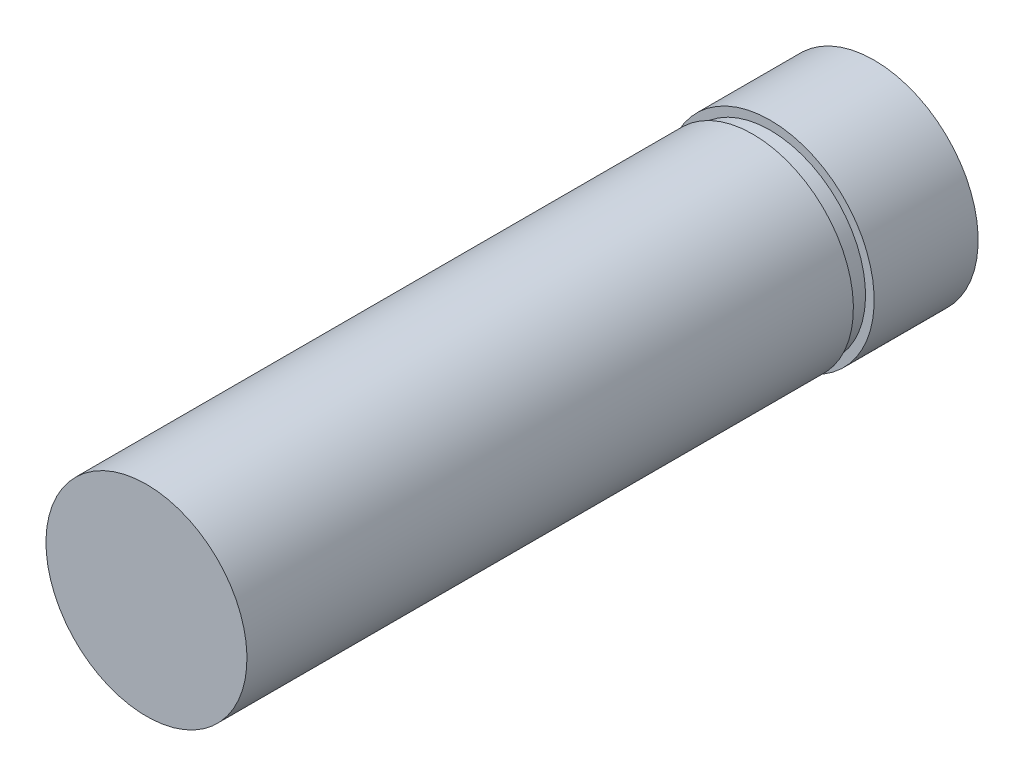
ISO-10303-21;
HEADER;
FILE_DESCRIPTION(('STEP AP214'),'2;1');
FILE_NAME('part.step','',(''),(''),'','','');
FILE_SCHEMA(('AUTOMOTIVE_DESIGN { 1 0 10303 214 1 1 1 1 }'));
ENDSEC;
DATA;
#1=APPLICATION_CONTEXT('core data for automotive mechanical design processes');
#2=APPLICATION_PROTOCOL_DEFINITION('international standard','automotive_design',2000,#1);
#3=PRODUCT_CONTEXT('',#1,'mechanical');
#4=PRODUCT('Part','Part','',(#3));
#5=PRODUCT_RELATED_PRODUCT_CATEGORY('part','',(#4));
#6=PRODUCT_DEFINITION_FORMATION('','',#4);
#7=PRODUCT_DEFINITION_CONTEXT('part definition',#1,'design');
#8=PRODUCT_DEFINITION('design','',#6,#7);
#9=PRODUCT_DEFINITION_SHAPE('','',#8);
#10=(LENGTH_UNIT() NAMED_UNIT(*) SI_UNIT(.MILLI.,.METRE.));
#11=(NAMED_UNIT(*) PLANE_ANGLE_UNIT() SI_UNIT($,.RADIAN.));
#12=(NAMED_UNIT(*) SI_UNIT($,.STERADIAN.) SOLID_ANGLE_UNIT());
#13=UNCERTAINTY_MEASURE_WITH_UNIT(LENGTH_MEASURE(1.E-05),#10,'distance_accuracy_value','');
#14=(GEOMETRIC_REPRESENTATION_CONTEXT(3) GLOBAL_UNCERTAINTY_ASSIGNED_CONTEXT((#13)) GLOBAL_UNIT_ASSIGNED_CONTEXT((#10,
#11,#12)) REPRESENTATION_CONTEXT('',''));
#15=CARTESIAN_POINT('',(0.,0.,0.));
#16=DIRECTION('',(0.,0.,1.));
#17=DIRECTION('',(1.,0.,0.));
#18=AXIS2_PLACEMENT_3D('',#15,#16,#17);
#19=CARTESIAN_POINT('',(2.9,0.,17.6));
#20=DIRECTION('',(0.,0.,1.));
#21=DIRECTION('',(0.,-1.,0.));
#22=AXIS2_PLACEMENT_3D('',#19,#20,#21);
#23=PLANE('',#22);
#24=CARTESIAN_POINT('',(0.,0.,17.6));
#25=DIRECTION('',(0.,0.,-1.));
#26=DIRECTION('',(0.,1.,0.));
#27=AXIS2_PLACEMENT_3D('',#24,#25,#26);
#28=CIRCLE('',#27,2.9);
#29=CARTESIAN_POINT('',(0.,2.90000000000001,17.6));
#30=VERTEX_POINT('',#29);
#31=EDGE_CURVE('E53',#30,#30,#28,.T.);
#32=ORIENTED_EDGE('',*,*,#31,.F.);
#33=EDGE_LOOP('',(#32));
#34=FACE_BOUND('',#33,.T.);
#35=ADVANCED_FACE('F31',(#34),#23,.T.);
#36=CARTESIAN_POINT('',(0.,0.,-3.4));
#37=DIRECTION('',(0.,0.,-1.));
#38=DIRECTION('',(0.,1.,0.));
#39=AXIS2_PLACEMENT_3D('',#36,#37,#38);
#40=PLANE('',#39);
#41=CARTESIAN_POINT('',(0.,0.,-3.4));
#42=DIRECTION('',(0.,0.,-1.));
#43=DIRECTION('',(0.,1.,0.));
#44=AXIS2_PLACEMENT_3D('',#41,#42,#43);
#45=CIRCLE('',#44,3.);
#46=CARTESIAN_POINT('',(0.,3.,-3.4));
#47=VERTEX_POINT('',#46);
#48=EDGE_CURVE('E10',#47,#47,#45,.T.);
#49=ORIENTED_EDGE('',*,*,#48,.T.);
#50=EDGE_LOOP('',(#49));
#51=FACE_BOUND('',#50,.T.);
#52=ADVANCED_FACE('F61',(#51),#40,.T.);
#53=CARTESIAN_POINT('',(0.,0.,17.6));
#54=DIRECTION('',(0.,0.,-1.));
#55=DIRECTION('',(0.,1.,0.));
#56=AXIS2_PLACEMENT_3D('',#53,#54,#55);
#57=CYLINDRICAL_SURFACE('',#56,3.);
#58=CARTESIAN_POINT('',(0.,0.,-0.399999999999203));
#59=DIRECTION('',(0.,0.,-1.));
#60=DIRECTION('',(0.,1.,0.));
#61=AXIS2_PLACEMENT_3D('',#58,#59,#60);
#62=CIRCLE('',#61,3.);
#63=CARTESIAN_POINT('',(0.,3.,-0.399999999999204));
#64=VERTEX_POINT('',#63);
#65=EDGE_CURVE('E37',#64,#64,#62,.T.);
#66=ORIENTED_EDGE('',*,*,#65,.T.);
#67=EDGE_LOOP('',(#66));
#68=FACE_BOUND('',#67,.T.);
#69=ORIENTED_EDGE('',*,*,#48,.F.);
#70=EDGE_LOOP('',(#69));
#71=FACE_BOUND('',#70,.T.);
#72=ADVANCED_FACE('F65',(#68,#71),#57,.T.);
#73=CARTESIAN_POINT('',(3.,0.,-0.399999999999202));
#74=DIRECTION('',(0.,0.,1.));
#75=DIRECTION('',(0.,-1.,0.));
#76=AXIS2_PLACEMENT_3D('',#73,#74,#75);
#77=PLANE('',#76);
#78=CARTESIAN_POINT('',(0.,0.,-0.399999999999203));
#79=DIRECTION('',(0.,0.,-1.));
#80=DIRECTION('',(0.,1.,0.));
#81=AXIS2_PLACEMENT_3D('',#78,#79,#80);
#82=CIRCLE('',#81,2.75);
#83=CARTESIAN_POINT('',(0.,2.75,-0.399999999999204));
#84=VERTEX_POINT('',#83);
#85=EDGE_CURVE('E41',#84,#84,#82,.T.);
#86=ORIENTED_EDGE('',*,*,#85,.T.);
#87=EDGE_LOOP('',(#86));
#88=FACE_BOUND('',#87,.T.);
#89=ORIENTED_EDGE('',*,*,#65,.F.);
#90=EDGE_LOOP('',(#89));
#91=FACE_BOUND('',#90,.T.);
#92=ADVANCED_FACE('F69',(#88,#91),#77,.T.);
#93=CARTESIAN_POINT('',(0.,0.,17.6));
#94=DIRECTION('',(0.,0.,-1.));
#95=DIRECTION('',(0.,1.,0.));
#96=AXIS2_PLACEMENT_3D('',#93,#94,#95);
#97=CYLINDRICAL_SURFACE('',#96,2.75);
#98=CARTESIAN_POINT('',(0.,0.,0.100000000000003));
#99=DIRECTION('',(0.,0.,-1.));
#100=DIRECTION('',(0.,1.,0.));
#101=AXIS2_PLACEMENT_3D('',#98,#99,#100);
#102=CIRCLE('',#101,2.75);
#103=CARTESIAN_POINT('',(0.,2.75,0.100000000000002));
#104=VERTEX_POINT('',#103);
#105=EDGE_CURVE('E45',#104,#104,#102,.T.);
#106=ORIENTED_EDGE('',*,*,#105,.T.);
#107=EDGE_LOOP('',(#106));
#108=FACE_BOUND('',#107,.T.);
#109=ORIENTED_EDGE('',*,*,#85,.F.);
#110=EDGE_LOOP('',(#109));
#111=FACE_BOUND('',#110,.T.);
#112=ADVANCED_FACE('F74',(#108,#111),#97,.T.);
#113=CARTESIAN_POINT('',(2.75,0.,0.100000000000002));
#114=DIRECTION('',(0.,0.,-1.));
#115=DIRECTION('',(0.,1.,0.));
#116=AXIS2_PLACEMENT_3D('',#113,#114,#115);
#117=PLANE('',#116);
#118=CARTESIAN_POINT('',(0.,0.,0.100000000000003));
#119=DIRECTION('',(0.,0.,-1.));
#120=DIRECTION('',(0.,1.,0.));
#121=AXIS2_PLACEMENT_3D('',#118,#119,#120);
#122=CIRCLE('',#121,2.9);
#123=CARTESIAN_POINT('',(0.,2.9,0.100000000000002));
#124=VERTEX_POINT('',#123);
#125=EDGE_CURVE('E50',#124,#124,#122,.T.);
#126=ORIENTED_EDGE('',*,*,#125,.T.);
#127=EDGE_LOOP('',(#126));
#128=FACE_BOUND('',#127,.T.);
#129=ORIENTED_EDGE('',*,*,#105,.F.);
#130=EDGE_LOOP('',(#129));
#131=FACE_BOUND('',#130,.T.);
#132=ADVANCED_FACE('F78',(#128,#131),#117,.T.);
#133=CARTESIAN_POINT('',(0.,0.,17.6));
#134=DIRECTION('',(0.,0.,-1.));
#135=DIRECTION('',(0.,1.,0.));
#136=AXIS2_PLACEMENT_3D('',#133,#134,#135);
#137=CYLINDRICAL_SURFACE('',#136,2.9);
#138=ORIENTED_EDGE('',*,*,#31,.T.);
#139=EDGE_LOOP('',(#138));
#140=FACE_BOUND('',#139,.T.);
#141=ORIENTED_EDGE('',*,*,#125,.F.);
#142=EDGE_LOOP('',(#141));
#143=FACE_BOUND('',#142,.T.);
#144=ADVANCED_FACE('F57',(#140,#143),#137,.T.);
#145=CLOSED_SHELL('',(#35,#52,#72,#92,#112,#132,#144));
#146=MANIFOLD_SOLID_BREP('B2',#145);
#147=ADVANCED_BREP_SHAPE_REPRESENTATION('',(#18,#146),#14);
#148=SHAPE_DEFINITION_REPRESENTATION(#9,#147);
ENDSEC;
END-ISO-10303-21;
